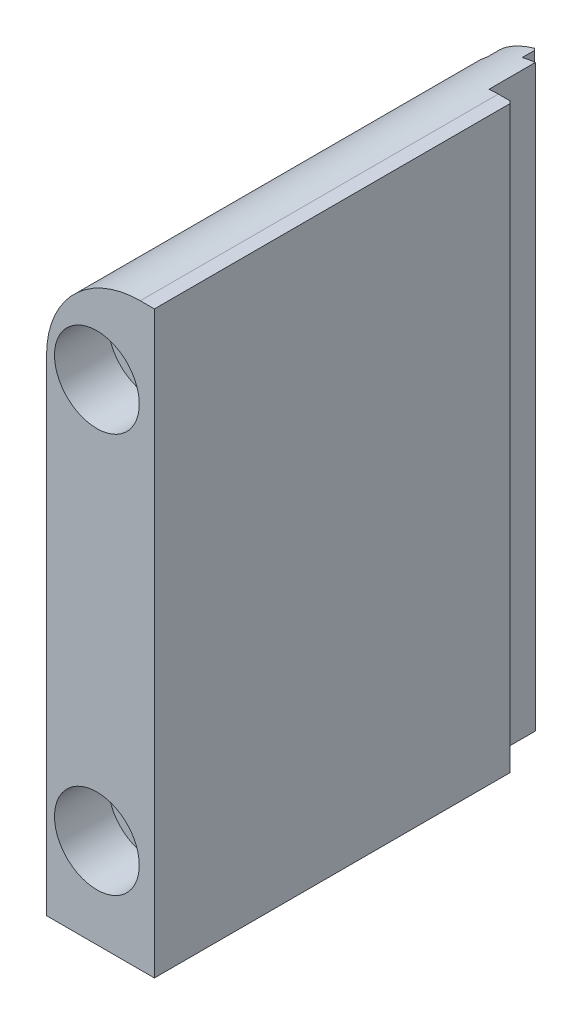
ISO-10303-21;
HEADER;
FILE_DESCRIPTION(('STEP AP214'),'2;1');
FILE_NAME('part.step','',(''),(''),'','','');
FILE_SCHEMA(('AUTOMOTIVE_DESIGN { 1 0 10303 214 1 1 1 1 }'));
ENDSEC;
DATA;
#1=APPLICATION_CONTEXT('core data for automotive mechanical design processes');
#2=APPLICATION_PROTOCOL_DEFINITION('international standard','automotive_design',2000,#1);
#3=PRODUCT_CONTEXT('',#1,'mechanical');
#4=PRODUCT('Part','Part','',(#3));
#5=PRODUCT_RELATED_PRODUCT_CATEGORY('part','',(#4));
#6=PRODUCT_DEFINITION_FORMATION('','',#4);
#7=PRODUCT_DEFINITION_CONTEXT('part definition',#1,'design');
#8=PRODUCT_DEFINITION('design','',#6,#7);
#9=PRODUCT_DEFINITION_SHAPE('','',#8);
#10=(LENGTH_UNIT() NAMED_UNIT(*) SI_UNIT(.MILLI.,.METRE.));
#11=(NAMED_UNIT(*) PLANE_ANGLE_UNIT() SI_UNIT($,.RADIAN.));
#12=(NAMED_UNIT(*) SI_UNIT($,.STERADIAN.) SOLID_ANGLE_UNIT());
#13=UNCERTAINTY_MEASURE_WITH_UNIT(LENGTH_MEASURE(1.E-05),#10,'distance_accuracy_value','');
#14=(GEOMETRIC_REPRESENTATION_CONTEXT(3) GLOBAL_UNCERTAINTY_ASSIGNED_CONTEXT((#13)) GLOBAL_UNIT_ASSIGNED_CONTEXT((#10,
#11,#12)) REPRESENTATION_CONTEXT('',''));
#15=CARTESIAN_POINT('',(0.,0.,0.));
#16=DIRECTION('',(0.,0.,1.));
#17=DIRECTION('',(1.,0.,0.));
#18=AXIS2_PLACEMENT_3D('',#15,#16,#17);
#19=CARTESIAN_POINT('',(-7.32028,29.845,-41.656));
#20=DIRECTION('',(0.,0.,-1.));
#21=DIRECTION('',(1.,0.,0.));
#22=AXIS2_PLACEMENT_3D('',#19,#20,#21);
#23=PLANE('',#22);
#24=CARTESIAN_POINT('',(-5.92328,-20.574,-41.656));
#25=DIRECTION('',(0.,0.,-1.));
#26=DIRECTION('',(-1.,0.,0.));
#27=AXIS2_PLACEMENT_3D('',#24,#25,#26);
#28=CIRCLE('',#27,2.7051);
#29=CARTESIAN_POINT('',(-8.62838,-20.574,-41.656));
#30=VERTEX_POINT('',#29);
#31=EDGE_CURVE('E408',#30,#30,#28,.T.);
#32=ORIENTED_EDGE('',*,*,#31,.F.);
#33=EDGE_LOOP('',(#32));
#34=FACE_BOUND('',#33,.T.);
#35=CARTESIAN_POINT('',(-5.92328,20.574,-41.656));
#36=DIRECTION('',(0.,0.,-1.));
#37=DIRECTION('',(-1.,0.,0.));
#38=AXIS2_PLACEMENT_3D('',#35,#36,#37);
#39=CIRCLE('',#38,2.7051);
#40=CARTESIAN_POINT('',(-8.62838,20.574,-41.656));
#41=VERTEX_POINT('',#40);
#42=EDGE_CURVE('E490',#41,#41,#39,.T.);
#43=ORIENTED_EDGE('',*,*,#42,.F.);
#44=EDGE_LOOP('',(#43));
#45=FACE_BOUND('',#44,.T.);
#46=DIRECTION('',(-0.999999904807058,0.000436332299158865,0.));
#47=VECTOR('',#46,1.);
#48=CARTESIAN_POINT('',(-7.32432497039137,20.5746113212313,-41.656));
#49=LINE('',#48,#47);
#50=CARTESIAN_POINT('',(-2.74802630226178,20.5726145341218,-41.656));
#51=VERTEX_POINT('',#50);
#52=CARTESIAN_POINT('',(-2.7482803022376,20.5726146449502,-41.656));
#53=VERTEX_POINT('',#52);
#54=EDGE_CURVE('E253',#51,#53,#49,.T.);
#55=ORIENTED_EDGE('',*,*,#54,.T.);
#56=CARTESIAN_POINT('',(-5.92328,20.574,-41.656));
#57=DIRECTION('',(0.,0.,1.));
#58=DIRECTION('',(1.,0.,0.));
#59=AXIS2_PLACEMENT_3D('',#56,#57,#58);
#60=CIRCLE('',#59,3.175);
#61=CARTESIAN_POINT('',(-2.74828,20.574,-41.656));
#62=VERTEX_POINT('',#61);
#63=EDGE_CURVE('E359',#62,#53,#60,.T.);
#64=ORIENTED_EDGE('',*,*,#63,.F.);
#65=DIRECTION('',(-1.,0.,0.));
#66=VECTOR('',#65,1.);
#67=CARTESIAN_POINT('',(-7.32028,20.574,-41.656));
#68=LINE('',#67,#66);
#69=CARTESIAN_POINT('',(-2.748026,20.574,-41.656));
#70=VERTEX_POINT('',#69);
#71=EDGE_CURVE('E446',#62,#70,#68,.F.);
#72=ORIENTED_EDGE('',*,*,#71,.T.);
#73=CARTESIAN_POINT('',(-5.92328,20.574,-41.656));
#74=DIRECTION('',(0.,0.,-1.));
#75=DIRECTION('',(-1.,0.,0.));
#76=AXIS2_PLACEMENT_3D('',#73,#74,#75);
#77=CIRCLE('',#76,3.175254);
#78=CARTESIAN_POINT('',(-3.76428,22.9022948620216,-41.656));
#79=VERTEX_POINT('',#78);
#80=EDGE_CURVE('E633',#79,#70,#77,.T.);
#81=ORIENTED_EDGE('',*,*,#80,.F.);
#82=DIRECTION('',(0.,-1.,0.));
#83=VECTOR('',#82,1.);
#84=CARTESIAN_POINT('',(-3.76428,29.845,-41.656));
#85=LINE('',#84,#83);
#86=CARTESIAN_POINT('',(-3.76428,29.5641543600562,-41.656));
#87=VERTEX_POINT('',#86);
#88=EDGE_CURVE('E262',#87,#79,#85,.T.);
#89=ORIENTED_EDGE('',*,*,#88,.F.);
#90=CARTESIAN_POINT('',(-1.45288000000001,20.193,-41.656));
#91=DIRECTION('',(0.,0.,1.));
#92=DIRECTION('',(1.,0.,0.));
#93=AXIS2_PLACEMENT_3D('',#90,#91,#92);
#94=CIRCLE('',#93,9.652);
#95=CARTESIAN_POINT('',(-2.413,29.797127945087,-41.656));
#96=VERTEX_POINT('',#95);
#97=EDGE_CURVE('E297',#96,#87,#94,.T.);
#98=ORIENTED_EDGE('',*,*,#97,.F.);
#99=DIRECTION('',(0.,-1.,0.));
#100=VECTOR('',#99,1.);
#101=CARTESIAN_POINT('',(-2.40538,29.845,-41.656));
#102=LINE('',#101,#100);
#103=CARTESIAN_POINT('',(-2.40538,-29.845,-41.656));
#104=VERTEX_POINT('',#103);
#105=EDGE_CURVE('E760',#96,#104,#102,.T.);
#106=ORIENTED_EDGE('',*,*,#105,.T.);
#107=DIRECTION('',(-1.,0.,0.));
#108=VECTOR('',#107,1.);
#109=CARTESIAN_POINT('',(-2.34188,-29.845,-41.656));
#110=LINE('',#109,#108);
#111=CARTESIAN_POINT('',(-3.76428,-29.845,-41.656));
#112=VERTEX_POINT('',#111);
#113=EDGE_CURVE('E496',#104,#112,#110,.T.);
#114=ORIENTED_EDGE('',*,*,#113,.T.);
#115=CARTESIAN_POINT('',(-3.76428,-22.9022948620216,-41.656));
#116=VERTEX_POINT('',#115);
#117=EDGE_CURVE('E263',#116,#112,#85,.T.);
#118=ORIENTED_EDGE('',*,*,#117,.F.);
#119=CARTESIAN_POINT('',(-5.92328,-20.574,-41.656));
#120=DIRECTION('',(0.,0.,-1.));
#121=DIRECTION('',(-1.,0.,0.));
#122=AXIS2_PLACEMENT_3D('',#119,#120,#121);
#123=CIRCLE('',#122,3.175254);
#124=CARTESIAN_POINT('',(-2.74802630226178,-20.5753854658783,-41.656));
#125=VERTEX_POINT('',#124);
#126=EDGE_CURVE('E461',#125,#116,#123,.T.);
#127=ORIENTED_EDGE('',*,*,#126,.F.);
#128=DIRECTION('',(-0.999999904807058,0.000436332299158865,0.));
#129=VECTOR('',#128,1.);
#130=CARTESIAN_POINT('',(-7.34227917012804,-20.5733808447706,-41.656));
#131=LINE('',#130,#129);
#132=CARTESIAN_POINT('',(-2.7482803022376,-20.5753853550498,-41.656));
#133=VERTEX_POINT('',#132);
#134=EDGE_CURVE('E445',#125,#133,#131,.T.);
#135=ORIENTED_EDGE('',*,*,#134,.T.);
#136=CARTESIAN_POINT('',(-5.92328,-20.574,-41.656));
#137=DIRECTION('',(0.,0.,1.));
#138=DIRECTION('',(1.,0.,0.));
#139=AXIS2_PLACEMENT_3D('',#136,#137,#138);
#140=CIRCLE('',#139,3.175);
#141=CARTESIAN_POINT('',(-2.74828,-20.574,-41.656));
#142=VERTEX_POINT('',#141);
#143=EDGE_CURVE('E378',#142,#133,#140,.T.);
#144=ORIENTED_EDGE('',*,*,#143,.F.);
#145=DIRECTION('',(-1.,0.,0.));
#146=VECTOR('',#145,1.);
#147=CARTESIAN_POINT('',(-7.32028,-20.574,-41.656));
#148=LINE('',#147,#146);
#149=CARTESIAN_POINT('',(-2.748026,-20.574,-41.656));
#150=VERTEX_POINT('',#149);
#151=EDGE_CURVE('E431',#142,#150,#148,.F.);
#152=ORIENTED_EDGE('',*,*,#151,.T.);
#153=CARTESIAN_POINT('',(-3.76428,-18.2457051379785,-41.656));
#154=VERTEX_POINT('',#153);
#155=EDGE_CURVE('E464',#154,#150,#123,.T.);
#156=ORIENTED_EDGE('',*,*,#155,.F.);
#157=CARTESIAN_POINT('',(-3.76428,18.2457051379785,-41.656));
#158=VERTEX_POINT('',#157);
#159=EDGE_CURVE('E260',#158,#154,#85,.T.);
#160=ORIENTED_EDGE('',*,*,#159,.F.);
#161=EDGE_CURVE('E641',#51,#158,#77,.T.);
#162=ORIENTED_EDGE('',*,*,#161,.F.);
#163=EDGE_LOOP('',(#55,#64,#72,#81,#89,#98,#106,#114,#118,#127,#135,#144,#152,#156,#160,#162));
#164=FACE_BOUND('',#163,.T.);
#165=ADVANCED_FACE('F16',(#34,#45,#164),#23,.T.);
#166=CARTESIAN_POINT('',(-5.92328,20.574,-31.2166));
#167=DIRECTION('',(0.,0.,1.));
#168=DIRECTION('',(1.,0.,0.));
#169=AXIS2_PLACEMENT_3D('',#166,#167,#168);
#170=CONICAL_SURFACE('',#169,3.3147,0.785398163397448);
#171=CARTESIAN_POINT('',(-5.92328,20.574,-31.8262));
#172=DIRECTION('',(0.,0.,1.));
#173=DIRECTION('',(1.,0.,0.));
#174=AXIS2_PLACEMENT_3D('',#171,#172,#173);
#175=CIRCLE('',#174,2.7051);
#176=CARTESIAN_POINT('',(-3.21818,20.574,-31.8262));
#177=VERTEX_POINT('',#176);
#178=EDGE_CURVE('E361',#177,#177,#175,.T.);
#179=ORIENTED_EDGE('',*,*,#178,.F.);
#180=EDGE_LOOP('',(#179));
#181=FACE_BOUND('',#180,.T.);
#182=CARTESIAN_POINT('',(-5.92328,20.574,-31.2166));
#183=DIRECTION('',(0.,0.,-1.));
#184=DIRECTION('',(-1.,0.,0.));
#185=AXIS2_PLACEMENT_3D('',#182,#183,#184);
#186=CIRCLE('',#185,3.3147);
#187=CARTESIAN_POINT('',(-9.23798,20.574,-31.2166));
#188=VERTEX_POINT('',#187);
#189=EDGE_CURVE('E405',#188,#188,#186,.T.);
#190=ORIENTED_EDGE('',*,*,#189,.F.);
#191=EDGE_LOOP('',(#190));
#192=FACE_BOUND('',#191,.T.);
#193=CARTESIAN_POINT('',(-5.92328,20.574,-31.3563));
#194=DIRECTION('',(0.,0.,1.));
#195=DIRECTION('',(1.,0.,0.));
#196=AXIS2_PLACEMENT_3D('',#193,#194,#195);
#197=CIRCLE('',#196,3.175);
#198=CARTESIAN_POINT('',(-2.7482803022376,20.5726146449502,-31.3563));
#199=VERTEX_POINT('',#198);
#200=CARTESIAN_POINT('',(-2.74828,20.574,-31.3563));
#201=VERTEX_POINT('',#200);
#202=EDGE_CURVE('E10',#199,#201,#197,.F.);
#203=ORIENTED_EDGE('',*,*,#202,.F.);
#204=DIRECTION('',(0.707106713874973,-0.000308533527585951,0.707106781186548));
#205=VECTOR('',#204,1.);
#206=CARTESIAN_POINT('',(-5.92328,20.574,-34.5313));
#207=LINE('',#206,#205);
#208=CARTESIAN_POINT('',(-2.74802630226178,20.5726145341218,-31.356046));
#209=VERTEX_POINT('',#208);
#210=EDGE_CURVE('E245',#209,#199,#207,.F.);
#211=ORIENTED_EDGE('',*,*,#210,.F.);
#212=CARTESIAN_POINT('',(-5.92328,20.574,-31.356046));
#213=DIRECTION('',(0.,0.,1.));
#214=DIRECTION('',(1.,0.,0.));
#215=AXIS2_PLACEMENT_3D('',#212,#213,#214);
#216=CIRCLE('',#215,3.175254);
#217=CARTESIAN_POINT('',(-2.748026,20.574,-31.356046));
#218=VERTEX_POINT('',#217);
#219=EDGE_CURVE('E237',#209,#218,#216,.F.);
#220=ORIENTED_EDGE('',*,*,#219,.T.);
#221=DIRECTION('',(0.707106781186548,0.,0.707106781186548));
#222=VECTOR('',#221,1.);
#223=CARTESIAN_POINT('',(-5.92328,20.574,-34.5313));
#224=LINE('',#223,#222);
#225=EDGE_CURVE('E26',#201,#218,#224,.T.);
#226=ORIENTED_EDGE('',*,*,#225,.F.);
#227=EDGE_LOOP('',(#203,#211,#220,#226));
#228=FACE_BOUND('',#227,.T.);
#229=ADVANCED_FACE('F256',(#181,#192,#228),#170,.F.);
#230=CARTESIAN_POINT('',(-7.32028,17.7225742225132,-41.656));
#231=VERTEX_POINT('',#230);
#232=CARTESIAN_POINT('',(-7.32028,23.4254257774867,-41.656));
#233=VERTEX_POINT('',#232);
#234=EDGE_CURVE('E611',#231,#233,#77,.T.);
#235=ORIENTED_EDGE('',*,*,#234,.F.);
#236=DIRECTION('',(0.,-1.,0.));
#237=VECTOR('',#236,1.);
#238=CARTESIAN_POINT('',(-7.32028,29.845,-41.656));
#239=LINE('',#238,#237);
#240=CARTESIAN_POINT('',(-7.32028,-17.7225742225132,-41.656));
#241=VERTEX_POINT('',#240);
#242=EDGE_CURVE('E20',#231,#241,#239,.T.);
#243=ORIENTED_EDGE('',*,*,#242,.T.);
#244=CARTESIAN_POINT('',(-7.32028,-23.4254257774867,-41.656));
#245=VERTEX_POINT('',#244);
#246=EDGE_CURVE('E465',#245,#241,#123,.T.);
#247=ORIENTED_EDGE('',*,*,#246,.F.);
#248=CARTESIAN_POINT('',(-7.32028,-29.845,-41.656));
#249=VERTEX_POINT('',#248);
#250=EDGE_CURVE('E279',#245,#249,#239,.T.);
#251=ORIENTED_EDGE('',*,*,#250,.T.);
#252=DIRECTION('',(-1.,0.,0.));
#253=VECTOR('',#252,1.);
#254=CARTESIAN_POINT('',(-7.32028,-29.845,-41.656));
#255=LINE('',#254,#253);
#256=CARTESIAN_POINT('',(-11.10488,-29.845,-41.656));
#257=VERTEX_POINT('',#256);
#258=EDGE_CURVE('E391',#249,#257,#255,.T.);
#259=ORIENTED_EDGE('',*,*,#258,.T.);
#260=DIRECTION('',(0.,-1.,0.));
#261=VECTOR('',#260,1.);
#262=CARTESIAN_POINT('',(-11.10488,29.845,-41.656));
#263=LINE('',#262,#261);
#264=CARTESIAN_POINT('',(-11.10488,20.193,-41.656));
#265=VERTEX_POINT('',#264);
#266=EDGE_CURVE('E280',#265,#257,#263,.T.);
#267=ORIENTED_EDGE('',*,*,#266,.F.);
#268=CARTESIAN_POINT('',(-1.45288000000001,20.193,-41.656));
#269=DIRECTION('',(0.,0.,1.));
#270=DIRECTION('',(1.,0.,0.));
#271=AXIS2_PLACEMENT_3D('',#268,#269,#270);
#272=CIRCLE('',#271,9.652);
#273=CARTESIAN_POINT('',(-7.32028,27.8568581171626,-41.656));
#274=VERTEX_POINT('',#273);
#275=EDGE_CURVE('E301',#274,#265,#272,.T.);
#276=ORIENTED_EDGE('',*,*,#275,.F.);
#277=EDGE_CURVE('E277',#274,#233,#239,.T.);
#278=ORIENTED_EDGE('',*,*,#277,.T.);
#279=EDGE_LOOP('',(#235,#243,#247,#251,#259,#267,#276,#278));
#280=FACE_BOUND('',#279,.T.);
#281=ADVANCED_FACE('F509',(#280),#23,.T.);
#282=CARTESIAN_POINT('',(-5.92328,-20.574,-31.2166));
#283=DIRECTION('',(0.,0.,1.));
#284=DIRECTION('',(1.,0.,0.));
#285=AXIS2_PLACEMENT_3D('',#282,#283,#284);
#286=CONICAL_SURFACE('',#285,3.3147,0.785398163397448);
#287=CARTESIAN_POINT('',(-5.92328,-20.574,-31.8262));
#288=DIRECTION('',(0.,0.,1.));
#289=DIRECTION('',(1.,0.,0.));
#290=AXIS2_PLACEMENT_3D('',#287,#288,#289);
#291=CIRCLE('',#290,2.7051);
#292=CARTESIAN_POINT('',(-3.21818,-20.574,-31.8262));
#293=VERTEX_POINT('',#292);
#294=EDGE_CURVE('E356',#293,#293,#291,.T.);
#295=ORIENTED_EDGE('',*,*,#294,.F.);
#296=EDGE_LOOP('',(#295));
#297=FACE_BOUND('',#296,.T.);
#298=CARTESIAN_POINT('',(-5.92328,-20.574,-31.2166));
#299=DIRECTION('',(0.,0.,-1.));
#300=DIRECTION('',(-1.,0.,0.));
#301=AXIS2_PLACEMENT_3D('',#298,#299,#300);
#302=CIRCLE('',#301,3.3147);
#303=CARTESIAN_POINT('',(-9.23798,-20.574,-31.2166));
#304=VERTEX_POINT('',#303);
#305=EDGE_CURVE('E364',#304,#304,#302,.T.);
#306=ORIENTED_EDGE('',*,*,#305,.F.);
#307=EDGE_LOOP('',(#306));
#308=FACE_BOUND('',#307,.T.);
#309=CARTESIAN_POINT('',(-5.92328,-20.574,-31.3563));
#310=DIRECTION('',(0.,0.,1.));
#311=DIRECTION('',(1.,0.,0.));
#312=AXIS2_PLACEMENT_3D('',#309,#310,#311);
#313=CIRCLE('',#312,3.175);
#314=CARTESIAN_POINT('',(-2.7482803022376,-20.5753853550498,-31.3563));
#315=VERTEX_POINT('',#314);
#316=CARTESIAN_POINT('',(-2.74828,-20.574,-31.3563));
#317=VERTEX_POINT('',#316);
#318=EDGE_CURVE('E246',#315,#317,#313,.F.);
#319=ORIENTED_EDGE('',*,*,#318,.F.);
#320=DIRECTION('',(0.707106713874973,-0.000308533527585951,0.707106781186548));
#321=VECTOR('',#320,1.);
#322=CARTESIAN_POINT('',(-5.92328,-20.574,-34.5313));
#323=LINE('',#322,#321);
#324=CARTESIAN_POINT('',(-2.74802630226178,-20.5753854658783,-31.356046));
#325=VERTEX_POINT('',#324);
#326=EDGE_CURVE('E411',#325,#315,#323,.F.);
#327=ORIENTED_EDGE('',*,*,#326,.F.);
#328=CARTESIAN_POINT('',(-5.92328,-20.574,-31.356046));
#329=DIRECTION('',(0.,0.,1.));
#330=DIRECTION('',(1.,0.,0.));
#331=AXIS2_PLACEMENT_3D('',#328,#329,#330);
#332=CIRCLE('',#331,3.175254);
#333=CARTESIAN_POINT('',(-2.748026,-20.574,-31.356046));
#334=VERTEX_POINT('',#333);
#335=EDGE_CURVE('E355',#325,#334,#332,.F.);
#336=ORIENTED_EDGE('',*,*,#335,.T.);
#337=DIRECTION('',(0.707106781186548,0.,0.707106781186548));
#338=VECTOR('',#337,1.);
#339=CARTESIAN_POINT('',(-5.92328,-20.574,-34.5313));
#340=LINE('',#339,#338);
#341=EDGE_CURVE('E412',#317,#334,#340,.T.);
#342=ORIENTED_EDGE('',*,*,#341,.F.);
#343=EDGE_LOOP('',(#319,#327,#336,#342));
#344=FACE_BOUND('',#343,.T.);
#345=ADVANCED_FACE('F434',(#297,#308,#344),#286,.F.);
#346=CARTESIAN_POINT('',(-3.76428,29.845,-41.656));
#347=DIRECTION('',(1.,0.,0.));
#348=DIRECTION('',(0.,0.,1.));
#349=AXIS2_PLACEMENT_3D('',#346,#347,#348);
#350=PLANE('',#349);
#351=DIRECTION('',(0.,0.,1.));
#352=VECTOR('',#351,1.);
#353=CARTESIAN_POINT('',(-3.76428,-22.9022948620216,-31.2166));
#354=LINE('',#353,#352);
#355=CARTESIAN_POINT('',(-3.76428,-22.9022948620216,-42.926));
#356=VERTEX_POINT('',#355);
#357=EDGE_CURVE('E459',#116,#356,#354,.F.);
#358=ORIENTED_EDGE('',*,*,#357,.F.);
#359=ORIENTED_EDGE('',*,*,#117,.T.);
#360=DIRECTION('',(0.,0.,-1.));
#361=VECTOR('',#360,1.);
#362=CARTESIAN_POINT('',(-3.76428,-29.845,-41.656));
#363=LINE('',#362,#361);
#364=CARTESIAN_POINT('',(-3.76428,-29.845,-42.926));
#365=VERTEX_POINT('',#364);
#366=EDGE_CURVE('E499',#112,#365,#363,.T.);
#367=ORIENTED_EDGE('',*,*,#366,.T.);
#368=DIRECTION('',(0.,1.,0.));
#369=VECTOR('',#368,1.);
#370=CARTESIAN_POINT('',(-3.76428,29.845,-42.926));
#371=LINE('',#370,#369);
#372=EDGE_CURVE('E344',#365,#356,#371,.T.);
#373=ORIENTED_EDGE('',*,*,#372,.T.);
#374=EDGE_LOOP('',(#358,#359,#367,#373));
#375=FACE_BOUND('',#374,.T.);
#376=ADVANCED_FACE('F552',(#375),#350,.T.);
#377=CARTESIAN_POINT('',(-7.32028,29.845,-42.926));
#378=DIRECTION('',(0.707106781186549,0.,0.707106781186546));
#379=DIRECTION('',(0.707106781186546,0.,-0.707106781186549));
#380=AXIS2_PLACEMENT_3D('',#377,#378,#379);
#381=PLANE('',#380);
#382=CARTESIAN_POINT('',(-5.92328,-20.574,-44.323));
#383=DIRECTION('',(0.707106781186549,0.,0.707106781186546));
#384=DIRECTION('',(-0.707106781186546,0.,0.707106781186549));
#385=AXIS2_PLACEMENT_3D('',#382,#383,#384);
#386=ELLIPSE('',#385,4.49048727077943,3.175254);
#387=CARTESIAN_POINT('',(-7.06628,-23.5363958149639,-43.18));
#388=VERTEX_POINT('',#387);
#389=CARTESIAN_POINT('',(-7.32028,-23.4254257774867,-42.926));
#390=VERTEX_POINT('',#389);
#391=EDGE_CURVE('E457',#388,#390,#386,.F.);
#392=ORIENTED_EDGE('',*,*,#391,.F.);
#393=DIRECTION('',(0.,1.,0.));
#394=VECTOR('',#393,1.);
#395=CARTESIAN_POINT('',(-7.06628,29.845,-43.18));
#396=LINE('',#395,#394);
#397=CARTESIAN_POINT('',(-7.06628,-29.845,-43.18));
#398=VERTEX_POINT('',#397);
#399=EDGE_CURVE('E335',#398,#388,#396,.T.);
#400=ORIENTED_EDGE('',*,*,#399,.F.);
#401=DIRECTION('',(-0.707106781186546,0.,0.707106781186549));
#402=VECTOR('',#401,1.);
#403=CARTESIAN_POINT('',(-7.32028,-29.845,-42.926));
#404=LINE('',#403,#402);
#405=CARTESIAN_POINT('',(-7.32028,-29.845,-42.926));
#406=VERTEX_POINT('',#405);
#407=EDGE_CURVE('E325',#406,#398,#404,.F.);
#408=ORIENTED_EDGE('',*,*,#407,.F.);
#409=DIRECTION('',(0.,-1.,0.));
#410=VECTOR('',#409,1.);
#411=CARTESIAN_POINT('',(-7.32028,29.845,-42.926));
#412=LINE('',#411,#410);
#413=EDGE_CURVE('E303',#390,#406,#412,.T.);
#414=ORIENTED_EDGE('',*,*,#413,.F.);
#415=EDGE_LOOP('',(#392,#400,#408,#414));
#416=FACE_BOUND('',#415,.T.);
#417=ADVANCED_FACE('F532',(#416),#381,.F.);
#418=CARTESIAN_POINT('',(-3.76428,29.845,-43.18));
#419=DIRECTION('',(0.,0.,-1.));
#420=DIRECTION('',(1.,0.,0.));
#421=AXIS2_PLACEMENT_3D('',#418,#419,#420);
#422=PLANE('',#421);
#423=CARTESIAN_POINT('',(-5.92328,20.574,-43.18));
#424=DIRECTION('',(0.,0.,-1.));
#425=DIRECTION('',(-1.,0.,0.));
#426=AXIS2_PLACEMENT_3D('',#423,#424,#425);
#427=CIRCLE('',#426,3.175254);
#428=CARTESIAN_POINT('',(-4.01828,18.0336825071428,-43.18));
#429=VERTEX_POINT('',#428);
#430=CARTESIAN_POINT('',(-7.06628,17.6116041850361,-43.18));
#431=VERTEX_POINT('',#430);
#432=EDGE_CURVE('E624',#429,#431,#427,.T.);
#433=ORIENTED_EDGE('',*,*,#432,.F.);
#434=DIRECTION('',(0.,-1.,0.));
#435=VECTOR('',#434,1.);
#436=CARTESIAN_POINT('',(-4.01828,29.845,-43.18));
#437=LINE('',#436,#435);
#438=CARTESIAN_POINT('',(-4.01828,-18.0336825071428,-43.18));
#439=VERTEX_POINT('',#438);
#440=EDGE_CURVE('E334',#429,#439,#437,.T.);
#441=ORIENTED_EDGE('',*,*,#440,.T.);
#442=CARTESIAN_POINT('',(-5.92328,-20.574,-43.18));
#443=DIRECTION('',(0.,0.,-1.));
#444=DIRECTION('',(-1.,0.,0.));
#445=AXIS2_PLACEMENT_3D('',#442,#443,#444);
#446=CIRCLE('',#445,3.175254);
#447=CARTESIAN_POINT('',(-7.06628,-17.6116041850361,-43.18));
#448=VERTEX_POINT('',#447);
#449=EDGE_CURVE('E472',#448,#439,#446,.T.);
#450=ORIENTED_EDGE('',*,*,#449,.F.);
#451=EDGE_CURVE('E339',#448,#431,#396,.T.);
#452=ORIENTED_EDGE('',*,*,#451,.T.);
#453=EDGE_LOOP('',(#433,#441,#450,#452));
#454=FACE_BOUND('',#453,.T.);
#455=ADVANCED_FACE('F623',(#454),#422,.T.);
#456=CARTESIAN_POINT('',(-7.32028,29.845,-43.18));
#457=DIRECTION('',(-1.,0.,0.));
#458=DIRECTION('',(0.,0.,-1.));
#459=AXIS2_PLACEMENT_3D('',#456,#457,#458);
#460=PLANE('',#459);
#461=DIRECTION('',(0.,0.,1.));
#462=VECTOR('',#461,1.);
#463=CARTESIAN_POINT('',(-7.32028,17.7225742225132,-31.2166));
#464=LINE('',#463,#462);
#465=CARTESIAN_POINT('',(-7.32028,17.7225742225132,-42.926));
#466=VERTEX_POINT('',#465);
#467=EDGE_CURVE('E610',#466,#231,#464,.T.);
#468=ORIENTED_EDGE('',*,*,#467,.F.);
#469=CARTESIAN_POINT('',(-7.32028,-17.7225742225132,-42.926));
#470=VERTEX_POINT('',#469);
#471=EDGE_CURVE('E307',#466,#470,#412,.T.);
#472=ORIENTED_EDGE('',*,*,#471,.T.);
#473=DIRECTION('',(0.,0.,1.));
#474=VECTOR('',#473,1.);
#475=CARTESIAN_POINT('',(-7.32028,-17.7225742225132,-31.2166));
#476=LINE('',#475,#474);
#477=EDGE_CURVE('E467',#241,#470,#476,.F.);
#478=ORIENTED_EDGE('',*,*,#477,.F.);
#479=ORIENTED_EDGE('',*,*,#242,.F.);
#480=EDGE_LOOP('',(#468,#472,#478,#479));
#481=FACE_BOUND('',#480,.T.);
#482=ADVANCED_FACE('F593',(#481),#460,.T.);
#483=CARTESIAN_POINT('',(-4.01828,29.845,-43.18));
#484=DIRECTION('',(-0.707106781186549,0.,0.707106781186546));
#485=DIRECTION('',(0.707106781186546,0.,0.707106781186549));
#486=AXIS2_PLACEMENT_3D('',#483,#484,#485);
#487=PLANE('',#486);
#488=CARTESIAN_POINT('',(-5.92328,20.574,-45.085));
#489=DIRECTION('',(-0.707106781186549,0.,0.707106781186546));
#490=DIRECTION('',(0.707106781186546,0.,0.707106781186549));
#491=AXIS2_PLACEMENT_3D('',#488,#489,#490);
#492=ELLIPSE('',#491,4.49048727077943,3.175254);
#493=CARTESIAN_POINT('',(-3.76428,18.2457051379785,-42.926));
#494=VERTEX_POINT('',#493);
#495=EDGE_CURVE('E638',#494,#429,#492,.F.);
#496=ORIENTED_EDGE('',*,*,#495,.F.);
#497=CARTESIAN_POINT('',(-3.76428,-18.2457051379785,-42.926));
#498=VERTEX_POINT('',#497);
#499=EDGE_CURVE('E348',#498,#494,#371,.T.);
#500=ORIENTED_EDGE('',*,*,#499,.F.);
#501=CARTESIAN_POINT('',(-5.92328,-20.574,-45.085));
#502=DIRECTION('',(-0.707106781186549,0.,0.707106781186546));
#503=DIRECTION('',(0.707106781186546,0.,0.707106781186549));
#504=AXIS2_PLACEMENT_3D('',#501,#502,#503);
#505=ELLIPSE('',#504,4.49048727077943,3.175254);
#506=EDGE_CURVE('E475',#439,#498,#505,.F.);
#507=ORIENTED_EDGE('',*,*,#506,.F.);
#508=ORIENTED_EDGE('',*,*,#440,.F.);
#509=EDGE_LOOP('',(#496,#500,#507,#508));
#510=FACE_BOUND('',#509,.T.);
#511=ADVANCED_FACE('F587',(#510),#487,.F.);
#512=DIRECTION('',(0.,0.,1.));
#513=VECTOR('',#512,1.);
#514=CARTESIAN_POINT('',(-3.76428,18.2457051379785,-31.2166));
#515=LINE('',#514,#513);
#516=EDGE_CURVE('E640',#158,#494,#515,.F.);
#517=ORIENTED_EDGE('',*,*,#516,.F.);
#518=ORIENTED_EDGE('',*,*,#159,.T.);
#519=DIRECTION('',(0.,0.,1.));
#520=VECTOR('',#519,1.);
#521=CARTESIAN_POINT('',(-3.76428,-18.2457051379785,-31.2166));
#522=LINE('',#521,#520);
#523=EDGE_CURVE('E477',#498,#154,#522,.T.);
#524=ORIENTED_EDGE('',*,*,#523,.F.);
#525=ORIENTED_EDGE('',*,*,#499,.T.);
#526=EDGE_LOOP('',(#517,#518,#524,#525));
#527=FACE_BOUND('',#526,.T.);
#528=ADVANCED_FACE('F560',(#527),#350,.T.);
#529=CARTESIAN_POINT('',(-5.92328,20.574,-43.18));
#530=DIRECTION('',(0.,0.,-1.));
#531=DIRECTION('',(-1.,0.,0.));
#532=AXIS2_PLACEMENT_3D('',#529,#530,#531);
#533=CIRCLE('',#532,3.175254);
#534=CARTESIAN_POINT('',(-7.06628,23.5363958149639,-43.18));
#535=VERTEX_POINT('',#534);
#536=CARTESIAN_POINT('',(-4.01828,23.1143174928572,-43.18));
#537=VERTEX_POINT('',#536);
#538=EDGE_CURVE('E616',#535,#537,#533,.T.);
#539=ORIENTED_EDGE('',*,*,#538,.F.);
#540=CARTESIAN_POINT('',(-7.06628,28.0448051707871,-43.18));
#541=VERTEX_POINT('',#540);
#542=EDGE_CURVE('E333',#535,#541,#396,.T.);
#543=ORIENTED_EDGE('',*,*,#542,.T.);
#544=CARTESIAN_POINT('',(-1.45288000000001,20.193,-43.18));
#545=DIRECTION('',(0.,0.,1.));
#546=DIRECTION('',(1.,0.,0.));
#547=AXIS2_PLACEMENT_3D('',#544,#545,#546);
#548=CIRCLE('',#547,9.652);
#549=CARTESIAN_POINT('',(-4.01828,29.4978281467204,-43.18));
#550=VERTEX_POINT('',#549);
#551=EDGE_CURVE('E296',#550,#541,#548,.T.);
#552=ORIENTED_EDGE('',*,*,#551,.F.);
#553=EDGE_CURVE('E330',#550,#537,#437,.T.);
#554=ORIENTED_EDGE('',*,*,#553,.T.);
#555=EDGE_LOOP('',(#539,#543,#552,#554));
#556=FACE_BOUND('',#555,.T.);
#557=ADVANCED_FACE('F615',(#556),#422,.T.);
#558=DIRECTION('',(0.,0.,1.));
#559=VECTOR('',#558,1.);
#560=CARTESIAN_POINT('',(-7.32028,23.4254257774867,-31.2166));
#561=LINE('',#560,#559);
#562=CARTESIAN_POINT('',(-7.32028,23.4254257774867,-42.926));
#563=VERTEX_POINT('',#562);
#564=EDGE_CURVE('E34',#233,#563,#561,.F.);
#565=ORIENTED_EDGE('',*,*,#564,.F.);
#566=ORIENTED_EDGE('',*,*,#277,.F.);
#567=DIRECTION('',(0.,0.,1.));
#568=VECTOR('',#567,1.);
#569=CARTESIAN_POINT('',(-7.32028,27.8568581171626,-43.18));
#570=LINE('',#569,#568);
#571=CARTESIAN_POINT('',(-7.32028,27.8568581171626,-42.926));
#572=VERTEX_POINT('',#571);
#573=EDGE_CURVE('E300',#572,#274,#570,.T.);
#574=ORIENTED_EDGE('',*,*,#573,.F.);
#575=EDGE_CURVE('E309',#572,#563,#412,.T.);
#576=ORIENTED_EDGE('',*,*,#575,.T.);
#577=EDGE_LOOP('',(#565,#566,#574,#576));
#578=FACE_BOUND('',#577,.T.);
#579=ADVANCED_FACE('F602',(#578),#460,.T.);
#580=CARTESIAN_POINT('',(-5.92328,20.574,-44.323));
#581=DIRECTION('',(0.707106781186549,0.,0.707106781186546));
#582=DIRECTION('',(-0.707106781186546,0.,0.707106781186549));
#583=AXIS2_PLACEMENT_3D('',#580,#581,#582);
#584=ELLIPSE('',#583,4.49048727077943,3.175254);
#585=EDGE_CURVE('E629',#431,#466,#584,.F.);
#586=ORIENTED_EDGE('',*,*,#585,.F.);
#587=ORIENTED_EDGE('',*,*,#451,.F.);
#588=CARTESIAN_POINT('',(-5.92328,-20.574,-44.323));
#589=DIRECTION('',(0.707106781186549,0.,0.707106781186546));
#590=DIRECTION('',(-0.707106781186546,0.,0.707106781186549));
#591=AXIS2_PLACEMENT_3D('',#588,#589,#590);
#592=ELLIPSE('',#591,4.49048727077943,3.175254);
#593=EDGE_CURVE('E470',#470,#448,#592,.F.);
#594=ORIENTED_EDGE('',*,*,#593,.F.);
#595=ORIENTED_EDGE('',*,*,#471,.F.);
#596=EDGE_LOOP('',(#586,#587,#594,#595));
#597=FACE_BOUND('',#596,.T.);
#598=ADVANCED_FACE('F533',(#597),#381,.F.);
#599=CARTESIAN_POINT('',(-5.92328,20.574,-45.085));
#600=DIRECTION('',(-0.707106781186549,0.,0.707106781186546));
#601=DIRECTION('',(0.707106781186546,0.,0.707106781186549));
#602=AXIS2_PLACEMENT_3D('',#599,#600,#601);
#603=ELLIPSE('',#602,4.49048727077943,3.175254);
#604=CARTESIAN_POINT('',(-3.76428,22.9022948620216,-42.926));
#605=VERTEX_POINT('',#604);
#606=EDGE_CURVE('E607',#537,#605,#603,.F.);
#607=ORIENTED_EDGE('',*,*,#606,.F.);
#608=ORIENTED_EDGE('',*,*,#553,.F.);
#609=CARTESIAN_POINT('',(-1.45288000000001,20.193,-40.6146));
#610=DIRECTION('',(-0.707106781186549,0.,0.707106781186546));
#611=DIRECTION('',(0.707106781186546,0.,0.707106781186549));
#612=AXIS2_PLACEMENT_3D('',#609,#610,#611);
#613=ELLIPSE('',#612,13.6499893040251,9.652);
#614=CARTESIAN_POINT('',(-3.76428,29.5641543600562,-42.926));
#615=VERTEX_POINT('',#614);
#616=EDGE_CURVE('E338',#615,#550,#613,.T.);
#617=ORIENTED_EDGE('',*,*,#616,.F.);
#618=EDGE_CURVE('E343',#605,#615,#371,.T.);
#619=ORIENTED_EDGE('',*,*,#618,.F.);
#620=EDGE_LOOP('',(#607,#608,#617,#619));
#621=FACE_BOUND('',#620,.T.);
#622=ADVANCED_FACE('F588',(#621),#487,.F.);
#623=CARTESIAN_POINT('',(-11.10488,29.845,-41.656));
#624=DIRECTION('',(-1.,0.,0.));
#625=DIRECTION('',(0.,0.,-1.));
#626=AXIS2_PLACEMENT_3D('',#623,#624,#625);
#627=PLANE('',#626);
#628=ORIENTED_EDGE('',*,*,#266,.T.);
#629=DIRECTION('',(0.,0.,1.));
#630=VECTOR('',#629,1.);
#631=CARTESIAN_POINT('',(-11.10488,-29.845,-41.656));
#632=LINE('',#631,#630);
#633=CARTESIAN_POINT('',(-11.10488,-29.845,0.));
#634=VERTEX_POINT('',#633);
#635=EDGE_CURVE('E268',#257,#634,#632,.T.);
#636=ORIENTED_EDGE('',*,*,#635,.T.);
#637=DIRECTION('',(0.,-1.,0.));
#638=VECTOR('',#637,1.);
#639=CARTESIAN_POINT('',(-11.10488,29.845,0.));
#640=LINE('',#639,#638);
#641=CARTESIAN_POINT('',(-11.10488,20.193,0.));
#642=VERTEX_POINT('',#641);
#643=EDGE_CURVE('E369',#642,#634,#640,.T.);
#644=ORIENTED_EDGE('',*,*,#643,.F.);
#645=DIRECTION('',(0.,0.,1.));
#646=VECTOR('',#645,1.);
#647=CARTESIAN_POINT('',(-11.10488,20.193,-41.656));
#648=LINE('',#647,#646);
#649=EDGE_CURVE('E366',#265,#642,#648,.T.);
#650=ORIENTED_EDGE('',*,*,#649,.F.);
#651=EDGE_LOOP('',(#628,#636,#644,#650));
#652=FACE_BOUND('',#651,.T.);
#653=ADVANCED_FACE('F513',(#652),#627,.T.);
#654=CARTESIAN_POINT('',(-11.07948,29.845,0.));
#655=DIRECTION('',(0.,0.,1.));
#656=DIRECTION('',(-1.,0.,0.));
#657=AXIS2_PLACEMENT_3D('',#654,#655,#656);
#658=PLANE('',#657);
#659=CARTESIAN_POINT('',(-5.92328,-20.574,0.));
#660=DIRECTION('',(0.,0.,1.));
#661=DIRECTION('',(1.,0.,0.));
#662=AXIS2_PLACEMENT_3D('',#659,#660,#661);
#663=CIRCLE('',#662,4.365625);
#664=CARTESIAN_POINT('',(-1.557655,-20.574,0.));
#665=VERTEX_POINT('',#664);
#666=EDGE_CURVE('E374',#665,#665,#663,.F.);
#667=ORIENTED_EDGE('',*,*,#666,.T.);
#668=EDGE_LOOP('',(#667));
#669=FACE_BOUND('',#668,.T.);
#670=CARTESIAN_POINT('',(-5.92328,20.574,0.));
#671=DIRECTION('',(0.,0.,1.));
#672=DIRECTION('',(1.,0.,0.));
#673=AXIS2_PLACEMENT_3D('',#670,#671,#672);
#674=CIRCLE('',#673,4.365625);
#675=CARTESIAN_POINT('',(-1.557655,20.574,0.));
#676=VERTEX_POINT('',#675);
#677=EDGE_CURVE('E379',#676,#676,#674,.F.);
#678=ORIENTED_EDGE('',*,*,#677,.T.);
#679=EDGE_LOOP('',(#678));
#680=FACE_BOUND('',#679,.T.);
#681=ORIENTED_EDGE('',*,*,#643,.T.);
#682=DIRECTION('',(1.,0.,0.));
#683=VECTOR('',#682,1.);
#684=CARTESIAN_POINT('',(-11.07948,-29.845,0.));
#685=LINE('',#684,#683);
#686=CARTESIAN_POINT('',(0.,-29.845,0.));
#687=VERTEX_POINT('',#686);
#688=EDGE_CURVE('E395',#634,#687,#685,.T.);
#689=ORIENTED_EDGE('',*,*,#688,.T.);
#690=DIRECTION('',(0.,-1.,0.));
#691=VECTOR('',#690,1.);
#692=CARTESIAN_POINT('',(0.,29.845,0.));
#693=LINE('',#692,#691);
#694=CARTESIAN_POINT('',(0.,29.845,0.));
#695=VERTEX_POINT('',#694);
#696=EDGE_CURVE('E385',#695,#687,#693,.T.);
#697=ORIENTED_EDGE('',*,*,#696,.F.);
#698=DIRECTION('',(1.,0.,0.));
#699=VECTOR('',#698,1.);
#700=CARTESIAN_POINT('',(-11.07948,29.845,0.));
#701=LINE('',#700,#699);
#702=CARTESIAN_POINT('',(-1.45288000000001,29.845,0.));
#703=VERTEX_POINT('',#702);
#704=EDGE_CURVE('E388',#703,#695,#701,.T.);
#705=ORIENTED_EDGE('',*,*,#704,.F.);
#706=CARTESIAN_POINT('',(-1.45288000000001,20.193,0.));
#707=DIRECTION('',(0.,0.,1.));
#708=DIRECTION('',(1.,0.,0.));
#709=AXIS2_PLACEMENT_3D('',#706,#707,#708);
#710=CIRCLE('',#709,9.652);
#711=EDGE_CURVE('E368',#642,#703,#710,.F.);
#712=ORIENTED_EDGE('',*,*,#711,.F.);
#713=EDGE_LOOP('',(#681,#689,#697,#705,#712));
#714=FACE_BOUND('',#713,.T.);
#715=ADVANCED_FACE('F515',(#669,#680,#714),#658,.T.);
#716=CARTESIAN_POINT('',(0.,29.845,-25.4));
#717=DIRECTION('',(1.,0.,0.));
#718=DIRECTION('',(0.,0.,1.));
#719=AXIS2_PLACEMENT_3D('',#716,#717,#718);
#720=PLANE('',#719);
#721=DIRECTION('',(0.,0.,-1.));
#722=VECTOR('',#721,1.);
#723=CARTESIAN_POINT('',(0.,-29.845,-36.8808));
#724=LINE('',#723,#722);
#725=CARTESIAN_POINT('',(0.,-29.845,-36.6268));
#726=VERTEX_POINT('',#725);
#727=EDGE_CURVE('E398',#687,#726,#724,.T.);
#728=ORIENTED_EDGE('',*,*,#727,.T.);
#729=DIRECTION('',(0.,1.,0.));
#730=VECTOR('',#729,1.);
#731=CARTESIAN_POINT('',(0.,29.845,-36.6268));
#732=LINE('',#731,#730);
#733=CARTESIAN_POINT('',(0.,29.845,-36.6268));
#734=VERTEX_POINT('',#733);
#735=EDGE_CURVE('E351',#726,#734,#732,.T.);
#736=ORIENTED_EDGE('',*,*,#735,.T.);
#737=DIRECTION('',(0.,0.,-1.));
#738=VECTOR('',#737,1.);
#739=CARTESIAN_POINT('',(0.,29.845,-36.8808));
#740=LINE('',#739,#738);
#741=EDGE_CURVE('E291',#695,#734,#740,.T.);
#742=ORIENTED_EDGE('',*,*,#741,.F.);
#743=ORIENTED_EDGE('',*,*,#696,.T.);
#744=EDGE_LOOP('',(#728,#736,#742,#743));
#745=FACE_BOUND('',#744,.T.);
#746=ADVANCED_FACE('F703',(#745),#720,.T.);
#747=CARTESIAN_POINT('',(0.00380999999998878,29.845,-36.8808));
#748=DIRECTION('',(0.,0.,-1.));
#749=DIRECTION('',(1.,0.,0.));
#750=AXIS2_PLACEMENT_3D('',#747,#748,#749);
#751=PLANE('',#750);
#752=DIRECTION('',(-1.,0.,0.));
#753=VECTOR('',#752,1.);
#754=CARTESIAN_POINT('',(0.00380999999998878,29.845,-36.8808));
#755=LINE('',#754,#753);
#756=CARTESIAN_POINT('',(-0.254000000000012,29.845,-36.8808));
#757=VERTEX_POINT('',#756);
#758=CARTESIAN_POINT('',(-1.45288000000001,29.845,-36.8808));
#759=VERTEX_POINT('',#758);
#760=EDGE_CURVE('E286',#757,#759,#755,.T.);
#761=ORIENTED_EDGE('',*,*,#760,.F.);
#762=DIRECTION('',(0.,-1.,0.));
#763=VECTOR('',#762,1.);
#764=CARTESIAN_POINT('',(-0.254000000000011,29.845,-36.8808));
#765=LINE('',#764,#763);
#766=CARTESIAN_POINT('',(-0.254000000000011,-29.845,-36.8808));
#767=VERTEX_POINT('',#766);
#768=EDGE_CURVE('E347',#757,#767,#765,.T.);
#769=ORIENTED_EDGE('',*,*,#768,.T.);
#770=DIRECTION('',(-1.,0.,0.));
#771=VECTOR('',#770,1.);
#772=CARTESIAN_POINT('',(0.00380999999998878,-29.845,-36.8808));
#773=LINE('',#772,#771);
#774=CARTESIAN_POINT('',(-2.40538,-29.845,-36.8808));
#775=VERTEX_POINT('',#774);
#776=EDGE_CURVE('E493',#767,#775,#773,.T.);
#777=ORIENTED_EDGE('',*,*,#776,.T.);
#778=DIRECTION('',(0.,-1.,0.));
#779=VECTOR('',#778,1.);
#780=CARTESIAN_POINT('',(-2.40538,29.845,-36.8808));
#781=LINE('',#780,#779);
#782=CARTESIAN_POINT('',(-2.40538,29.797127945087,-36.8808));
#783=VERTEX_POINT('',#782);
#784=EDGE_CURVE('E394',#783,#775,#781,.T.);
#785=ORIENTED_EDGE('',*,*,#784,.F.);
#786=CARTESIAN_POINT('',(-1.45288000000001,20.193,-36.8808));
#787=DIRECTION('',(0.,0.,1.));
#788=DIRECTION('',(1.,0.,0.));
#789=AXIS2_PLACEMENT_3D('',#786,#787,#788);
#790=CIRCLE('',#789,9.652);
#791=EDGE_CURVE('E373',#759,#783,#790,.T.);
#792=ORIENTED_EDGE('',*,*,#791,.F.);
#793=EDGE_LOOP('',(#761,#769,#777,#785,#792));
#794=FACE_BOUND('',#793,.T.);
#795=ADVANCED_FACE('F709',(#794),#751,.T.);
#796=CARTESIAN_POINT('',(-2.40538,29.845,-36.8808));
#797=DIRECTION('',(1.,0.,0.));
#798=DIRECTION('',(0.,0.,1.));
#799=AXIS2_PLACEMENT_3D('',#796,#797,#798);
#800=PLANE('',#799);
#801=DIRECTION('',(0.,0.,-1.));
#802=VECTOR('',#801,1.);
#803=CARTESIAN_POINT('',(-2.40538,-29.845,-36.8808));
#804=LINE('',#803,#802);
#805=EDGE_CURVE('E495',#775,#104,#804,.T.);
#806=ORIENTED_EDGE('',*,*,#805,.T.);
#807=ORIENTED_EDGE('',*,*,#105,.F.);
#808=DIRECTION('',(0.,0.,1.));
#809=VECTOR('',#808,1.);
#810=CARTESIAN_POINT('',(-2.40538,29.7978866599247,-36.8808));
#811=LINE('',#810,#809);
#812=EDGE_CURVE('E749',#783,#96,#811,.F.);
#813=ORIENTED_EDGE('',*,*,#812,.F.);
#814=ORIENTED_EDGE('',*,*,#784,.T.);
#815=EDGE_LOOP('',(#806,#807,#813,#814));
#816=FACE_BOUND('',#815,.T.);
#817=ADVANCED_FACE('F716',(#816),#800,.T.);
#818=DIRECTION('',(0.,0.,1.));
#819=VECTOR('',#818,1.);
#820=CARTESIAN_POINT('',(-3.76428,22.9022948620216,-31.2166));
#821=LINE('',#820,#819);
#822=EDGE_CURVE('E631',#605,#79,#821,.T.);
#823=ORIENTED_EDGE('',*,*,#822,.F.);
#824=ORIENTED_EDGE('',*,*,#618,.T.);
#825=DIRECTION('',(0.,0.,1.));
#826=VECTOR('',#825,1.);
#827=CARTESIAN_POINT('',(-3.76428,29.5641543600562,-41.656));
#828=LINE('',#827,#826);
#829=EDGE_CURVE('E293',#87,#615,#828,.F.);
#830=ORIENTED_EDGE('',*,*,#829,.F.);
#831=ORIENTED_EDGE('',*,*,#88,.T.);
#832=EDGE_LOOP('',(#823,#824,#830,#831));
#833=FACE_BOUND('',#832,.T.);
#834=ADVANCED_FACE('F561',(#833),#350,.T.);
#835=CARTESIAN_POINT('',(-5.92328,-20.574,-43.18));
#836=DIRECTION('',(0.,0.,-1.));
#837=DIRECTION('',(-1.,0.,0.));
#838=AXIS2_PLACEMENT_3D('',#835,#836,#837);
#839=CIRCLE('',#838,3.175254);
#840=CARTESIAN_POINT('',(-4.01828,-23.1143174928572,-43.18));
#841=VERTEX_POINT('',#840);
#842=EDGE_CURVE('E455',#841,#388,#839,.T.);
#843=ORIENTED_EDGE('',*,*,#842,.F.);
#844=CARTESIAN_POINT('',(-4.01828,-29.845,-43.18));
#845=VERTEX_POINT('',#844);
#846=EDGE_CURVE('E329',#841,#845,#437,.T.);
#847=ORIENTED_EDGE('',*,*,#846,.T.);
#848=DIRECTION('',(-1.,0.,0.));
#849=VECTOR('',#848,1.);
#850=CARTESIAN_POINT('',(-3.76428,-29.845,-43.18));
#851=LINE('',#850,#849);
#852=EDGE_CURVE('E502',#845,#398,#851,.T.);
#853=ORIENTED_EDGE('',*,*,#852,.T.);
#854=ORIENTED_EDGE('',*,*,#399,.T.);
#855=EDGE_LOOP('',(#843,#847,#853,#854));
#856=FACE_BOUND('',#855,.T.);
#857=ADVANCED_FACE('F724',(#856),#422,.T.);
#858=DIRECTION('',(0.,0.,1.));
#859=VECTOR('',#858,1.);
#860=CARTESIAN_POINT('',(-7.32028,-23.4254257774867,-31.2166));
#861=LINE('',#860,#859);
#862=EDGE_CURVE('E463',#390,#245,#861,.T.);
#863=ORIENTED_EDGE('',*,*,#862,.F.);
#864=ORIENTED_EDGE('',*,*,#413,.T.);
#865=DIRECTION('',(0.,0.,1.));
#866=VECTOR('',#865,1.);
#867=CARTESIAN_POINT('',(-7.32028,-29.845,-43.18));
#868=LINE('',#867,#866);
#869=EDGE_CURVE('E505',#406,#249,#868,.T.);
#870=ORIENTED_EDGE('',*,*,#869,.T.);
#871=ORIENTED_EDGE('',*,*,#250,.F.);
#872=EDGE_LOOP('',(#863,#864,#870,#871));
#873=FACE_BOUND('',#872,.T.);
#874=ADVANCED_FACE('F727',(#873),#460,.T.);
#875=CARTESIAN_POINT('',(-11.07948,29.845,-36.8808));
#876=DIRECTION('',(0.,1.,0.));
#877=DIRECTION('',(0.,0.,1.));
#878=AXIS2_PLACEMENT_3D('',#875,#876,#877);
#879=PLANE('',#878);
#880=ORIENTED_EDGE('',*,*,#741,.T.);
#881=DIRECTION('',(0.707106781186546,0.,0.707106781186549));
#882=VECTOR('',#881,1.);
#883=CARTESIAN_POINT('',(-5.66674,29.845,-42.29354));
#884=LINE('',#883,#882);
#885=EDGE_CURVE('E353',#734,#757,#884,.F.);
#886=ORIENTED_EDGE('',*,*,#885,.T.);
#887=ORIENTED_EDGE('',*,*,#760,.T.);
#888=DIRECTION('',(0.,0.,1.));
#889=VECTOR('',#888,1.);
#890=CARTESIAN_POINT('',(-1.45288000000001,29.845,-36.8808));
#891=LINE('',#890,#889);
#892=EDGE_CURVE('E370',#703,#759,#891,.F.);
#893=ORIENTED_EDGE('',*,*,#892,.F.);
#894=ORIENTED_EDGE('',*,*,#704,.T.);
#895=EDGE_LOOP('',(#880,#886,#887,#893,#894));
#896=FACE_BOUND('',#895,.T.);
#897=ADVANCED_FACE('F534',(#896),#879,.T.);
#898=CARTESIAN_POINT('',(-11.07948,-29.845,-36.8808));
#899=DIRECTION('',(0.,1.,0.));
#900=DIRECTION('',(0.,0.,1.));
#901=AXIS2_PLACEMENT_3D('',#898,#899,#900);
#902=PLANE('',#901);
#903=ORIENTED_EDGE('',*,*,#869,.F.);
#904=ORIENTED_EDGE('',*,*,#407,.T.);
#905=ORIENTED_EDGE('',*,*,#852,.F.);
#906=DIRECTION('',(-0.707106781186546,0.,-0.707106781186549));
#907=VECTOR('',#906,1.);
#908=CARTESIAN_POINT('',(-4.01828,-29.845,-43.18));
#909=LINE('',#908,#907);
#910=EDGE_CURVE('E321',#845,#365,#909,.F.);
#911=ORIENTED_EDGE('',*,*,#910,.T.);
#912=ORIENTED_EDGE('',*,*,#366,.F.);
#913=ORIENTED_EDGE('',*,*,#113,.F.);
#914=ORIENTED_EDGE('',*,*,#805,.F.);
#915=ORIENTED_EDGE('',*,*,#776,.F.);
#916=DIRECTION('',(-0.707106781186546,0.,-0.707106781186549));
#917=VECTOR('',#916,1.);
#918=CARTESIAN_POINT('',(-0.254000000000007,-29.845,-36.8808));
#919=LINE('',#918,#917);
#920=EDGE_CURVE('E317',#767,#726,#919,.F.);
#921=ORIENTED_EDGE('',*,*,#920,.T.);
#922=ORIENTED_EDGE('',*,*,#727,.F.);
#923=ORIENTED_EDGE('',*,*,#688,.F.);
#924=ORIENTED_EDGE('',*,*,#635,.F.);
#925=ORIENTED_EDGE('',*,*,#258,.F.);
#926=EDGE_LOOP('',(#903,#904,#905,#911,#912,#913,#914,#915,#921,#922,#923,#924,#925));
#927=FACE_BOUND('',#926,.T.);
#928=ADVANCED_FACE('F511',(#927),#902,.F.);
#929=CARTESIAN_POINT('',(-1.45288000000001,20.193,-41.656));
#930=DIRECTION('',(0.,0.,1.));
#931=DIRECTION('',(0.,-1.,0.));
#932=AXIS2_PLACEMENT_3D('',#929,#930,#931);
#933=CYLINDRICAL_SURFACE('',#932,9.652);
#934=ORIENTED_EDGE('',*,*,#551,.T.);
#935=CARTESIAN_POINT('',(-1.45288000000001,20.193,-48.7934));
#936=DIRECTION('',(0.707106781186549,0.,0.707106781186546));
#937=DIRECTION('',(-0.707106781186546,0.,0.707106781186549));
#938=AXIS2_PLACEMENT_3D('',#935,#936,#937);
#939=ELLIPSE('',#938,13.6499893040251,9.652);
#940=EDGE_CURVE('E341',#541,#572,#939,.T.);
#941=ORIENTED_EDGE('',*,*,#940,.T.);
#942=ORIENTED_EDGE('',*,*,#573,.T.);
#943=ORIENTED_EDGE('',*,*,#275,.T.);
#944=ORIENTED_EDGE('',*,*,#649,.T.);
#945=ORIENTED_EDGE('',*,*,#711,.T.);
#946=ORIENTED_EDGE('',*,*,#892,.T.);
#947=ORIENTED_EDGE('',*,*,#791,.T.);
#948=ORIENTED_EDGE('',*,*,#812,.T.);
#949=ORIENTED_EDGE('',*,*,#97,.T.);
#950=ORIENTED_EDGE('',*,*,#829,.T.);
#951=ORIENTED_EDGE('',*,*,#616,.T.);
#952=EDGE_LOOP('',(#934,#941,#942,#943,#944,#945,#946,#947,#948,#949,#950,#951));
#953=FACE_BOUND('',#952,.T.);
#954=ADVANCED_FACE('F518',(#953),#933,.T.);
#955=CARTESIAN_POINT('',(-5.92328,20.574,-44.323));
#956=DIRECTION('',(0.707106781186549,0.,0.707106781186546));
#957=DIRECTION('',(-0.707106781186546,0.,0.707106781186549));
#958=AXIS2_PLACEMENT_3D('',#955,#956,#957);
#959=ELLIPSE('',#958,4.49048727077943,3.175254);
#960=EDGE_CURVE('E646',#563,#535,#959,.F.);
#961=ORIENTED_EDGE('',*,*,#960,.F.);
#962=ORIENTED_EDGE('',*,*,#575,.F.);
#963=ORIENTED_EDGE('',*,*,#940,.F.);
#964=ORIENTED_EDGE('',*,*,#542,.F.);
#965=EDGE_LOOP('',(#961,#962,#963,#964));
#966=FACE_BOUND('',#965,.T.);
#967=ADVANCED_FACE('F522',(#966),#381,.F.);
#968=CARTESIAN_POINT('',(-5.92328,-20.574,-45.085));
#969=DIRECTION('',(-0.707106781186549,0.,0.707106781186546));
#970=DIRECTION('',(0.707106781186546,0.,0.707106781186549));
#971=AXIS2_PLACEMENT_3D('',#968,#969,#970);
#972=ELLIPSE('',#971,4.49048727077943,3.175254);
#973=EDGE_CURVE('E432',#356,#841,#972,.F.);
#974=ORIENTED_EDGE('',*,*,#973,.F.);
#975=ORIENTED_EDGE('',*,*,#372,.F.);
#976=ORIENTED_EDGE('',*,*,#910,.F.);
#977=ORIENTED_EDGE('',*,*,#846,.F.);
#978=EDGE_LOOP('',(#974,#975,#976,#977));
#979=FACE_BOUND('',#978,.T.);
#980=ADVANCED_FACE('F529',(#979),#487,.F.);
#981=CARTESIAN_POINT('',(-0.254000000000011,29.845,-36.8808));
#982=DIRECTION('',(-0.707106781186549,0.,0.707106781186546));
#983=DIRECTION('',(0.707106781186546,0.,0.707106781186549));
#984=AXIS2_PLACEMENT_3D('',#981,#982,#983);
#985=PLANE('',#984);
#986=ORIENTED_EDGE('',*,*,#885,.F.);
#987=ORIENTED_EDGE('',*,*,#735,.F.);
#988=ORIENTED_EDGE('',*,*,#920,.F.);
#989=ORIENTED_EDGE('',*,*,#768,.F.);
#990=EDGE_LOOP('',(#986,#987,#988,#989));
#991=FACE_BOUND('',#990,.T.);
#992=ADVANCED_FACE('F580',(#991),#985,.F.);
#993=CARTESIAN_POINT('',(-5.92328,20.574,-25.4));
#994=DIRECTION('',(0.,0.,-1.));
#995=DIRECTION('',(-1.,0.,0.));
#996=AXIS2_PLACEMENT_3D('',#993,#994,#995);
#997=CYLINDRICAL_SURFACE('',#996,2.7051);
#998=ORIENTED_EDGE('',*,*,#178,.T.);
#999=EDGE_LOOP('',(#998));
#1000=FACE_BOUND('',#999,.T.);
#1001=ORIENTED_EDGE('',*,*,#42,.T.);
#1002=EDGE_LOOP('',(#1001));
#1003=FACE_BOUND('',#1002,.T.);
#1004=ADVANCED_FACE('F576',(#1000,#1003),#997,.F.);
#1005=CARTESIAN_POINT('',(-5.92328,-20.574,-25.4));
#1006=DIRECTION('',(0.,0.,-1.));
#1007=DIRECTION('',(-1.,0.,0.));
#1008=AXIS2_PLACEMENT_3D('',#1005,#1006,#1007);
#1009=CYLINDRICAL_SURFACE('',#1008,2.7051);
#1010=ORIENTED_EDGE('',*,*,#294,.T.);
#1011=EDGE_LOOP('',(#1010));
#1012=FACE_BOUND('',#1011,.T.);
#1013=ORIENTED_EDGE('',*,*,#31,.T.);
#1014=EDGE_LOOP('',(#1013));
#1015=FACE_BOUND('',#1014,.T.);
#1016=ADVANCED_FACE('F572',(#1012,#1015),#1009,.F.);
#1017=CARTESIAN_POINT('',(-5.92328,20.574,-5.5372));
#1018=DIRECTION('',(0.,0.,-1.));
#1019=DIRECTION('',(-1.,0.,0.));
#1020=AXIS2_PLACEMENT_3D('',#1017,#1018,#1019);
#1021=PLANE('',#1020);
#1022=CARTESIAN_POINT('',(-5.92328,20.574,-5.5372));
#1023=DIRECTION('',(0.,0.,-1.));
#1024=DIRECTION('',(-1.,0.,0.));
#1025=AXIS2_PLACEMENT_3D('',#1022,#1023,#1024);
#1026=CIRCLE('',#1025,3.3147);
#1027=CARTESIAN_POINT('',(-9.23798,20.574,-5.5372));
#1028=VERTEX_POINT('',#1027);
#1029=EDGE_CURVE('E365',#1028,#1028,#1026,.T.);
#1030=ORIENTED_EDGE('',*,*,#1029,.T.);
#1031=EDGE_LOOP('',(#1030));
#1032=FACE_BOUND('',#1031,.T.);
#1033=CARTESIAN_POINT('',(-5.92328,20.574,-5.5372));
#1034=DIRECTION('',(0.,0.,-1.));
#1035=DIRECTION('',(-1.,0.,0.));
#1036=AXIS2_PLACEMENT_3D('',#1033,#1034,#1035);
#1037=CIRCLE('',#1036,4.365625);
#1038=CARTESIAN_POINT('',(-10.288905,20.574,-5.5372));
#1039=VERTEX_POINT('',#1038);
#1040=EDGE_CURVE('E382',#1039,#1039,#1037,.T.);
#1041=ORIENTED_EDGE('',*,*,#1040,.F.);
#1042=EDGE_LOOP('',(#1041));
#1043=FACE_BOUND('',#1042,.T.);
#1044=ADVANCED_FACE('F575',(#1032,#1043),#1021,.F.);
#1045=CARTESIAN_POINT('',(-5.92328,20.574,-25.4));
#1046=DIRECTION('',(0.,0.,-1.));
#1047=DIRECTION('',(-1.,0.,0.));
#1048=AXIS2_PLACEMENT_3D('',#1045,#1046,#1047);
#1049=CYLINDRICAL_SURFACE('',#1048,4.365625);
#1050=ORIENTED_EDGE('',*,*,#1040,.T.);
#1051=EDGE_LOOP('',(#1050));
#1052=FACE_BOUND('',#1051,.T.);
#1053=ORIENTED_EDGE('',*,*,#677,.F.);
#1054=EDGE_LOOP('',(#1053));
#1055=FACE_BOUND('',#1054,.T.);
#1056=ADVANCED_FACE('F694',(#1052,#1055),#1049,.F.);
#1057=CARTESIAN_POINT('',(-5.92328,-20.574,-5.5372));
#1058=DIRECTION('',(0.,0.,-1.));
#1059=DIRECTION('',(-1.,0.,0.));
#1060=AXIS2_PLACEMENT_3D('',#1057,#1058,#1059);
#1061=PLANE('',#1060);
#1062=CARTESIAN_POINT('',(-5.92328,-20.574,-5.5372));
#1063=DIRECTION('',(0.,0.,-1.));
#1064=DIRECTION('',(-1.,0.,0.));
#1065=AXIS2_PLACEMENT_3D('',#1062,#1063,#1064);
#1066=CIRCLE('',#1065,3.3147);
#1067=CARTESIAN_POINT('',(-9.23798,-20.574,-5.5372));
#1068=VERTEX_POINT('',#1067);
#1069=EDGE_CURVE('E360',#1068,#1068,#1066,.T.);
#1070=ORIENTED_EDGE('',*,*,#1069,.T.);
#1071=EDGE_LOOP('',(#1070));
#1072=FACE_BOUND('',#1071,.T.);
#1073=CARTESIAN_POINT('',(-5.92328,-20.574,-5.5372));
#1074=DIRECTION('',(0.,0.,-1.));
#1075=DIRECTION('',(-1.,0.,0.));
#1076=AXIS2_PLACEMENT_3D('',#1073,#1074,#1075);
#1077=CIRCLE('',#1076,4.365625);
#1078=CARTESIAN_POINT('',(-10.288905,-20.574,-5.5372));
#1079=VERTEX_POINT('',#1078);
#1080=EDGE_CURVE('E377',#1079,#1079,#1077,.T.);
#1081=ORIENTED_EDGE('',*,*,#1080,.F.);
#1082=EDGE_LOOP('',(#1081));
#1083=FACE_BOUND('',#1082,.T.);
#1084=ADVANCED_FACE('F18',(#1072,#1083),#1061,.F.);
#1085=CARTESIAN_POINT('',(-5.92328,-20.574,-25.4));
#1086=DIRECTION('',(0.,0.,-1.));
#1087=DIRECTION('',(-1.,0.,0.));
#1088=AXIS2_PLACEMENT_3D('',#1085,#1086,#1087);
#1089=CYLINDRICAL_SURFACE('',#1088,4.365625);
#1090=ORIENTED_EDGE('',*,*,#1080,.T.);
#1091=EDGE_LOOP('',(#1090));
#1092=FACE_BOUND('',#1091,.T.);
#1093=ORIENTED_EDGE('',*,*,#666,.F.);
#1094=EDGE_LOOP('',(#1093));
#1095=FACE_BOUND('',#1094,.T.);
#1096=ADVANCED_FACE('F570',(#1092,#1095),#1089,.F.);
#1097=CARTESIAN_POINT('',(-5.92328,-20.574,-12.7));
#1098=DIRECTION('',(0.,0.,-1.));
#1099=DIRECTION('',(-1.,0.,0.));
#1100=AXIS2_PLACEMENT_3D('',#1097,#1098,#1099);
#1101=CYLINDRICAL_SURFACE('',#1100,3.3147);
#1102=ORIENTED_EDGE('',*,*,#305,.T.);
#1103=EDGE_LOOP('',(#1102));
#1104=FACE_BOUND('',#1103,.T.);
#1105=ORIENTED_EDGE('',*,*,#1069,.F.);
#1106=EDGE_LOOP('',(#1105));
#1107=FACE_BOUND('',#1106,.T.);
#1108=ADVANCED_FACE('F567',(#1104,#1107),#1101,.F.);
#1109=CARTESIAN_POINT('',(-5.92328,20.574,-12.7));
#1110=DIRECTION('',(0.,0.,-1.));
#1111=DIRECTION('',(-1.,0.,0.));
#1112=AXIS2_PLACEMENT_3D('',#1109,#1110,#1111);
#1113=CYLINDRICAL_SURFACE('',#1112,3.3147);
#1114=ORIENTED_EDGE('',*,*,#189,.T.);
#1115=EDGE_LOOP('',(#1114));
#1116=FACE_BOUND('',#1115,.T.);
#1117=ORIENTED_EDGE('',*,*,#1029,.F.);
#1118=EDGE_LOOP('',(#1117));
#1119=FACE_BOUND('',#1118,.T.);
#1120=ADVANCED_FACE('F566',(#1116,#1119),#1113,.F.);
#1121=CARTESIAN_POINT('',(-2.74828,-20.574,-37.5666));
#1122=DIRECTION('',(0.,-1.,0.));
#1123=DIRECTION('',(0.,0.,-1.));
#1124=AXIS2_PLACEMENT_3D('',#1121,#1122,#1123);
#1125=PLANE('',#1124);
#1126=DIRECTION('',(0.,0.,-1.));
#1127=VECTOR('',#1126,1.);
#1128=CARTESIAN_POINT('',(-2.74828,-20.574,-31.2166));
#1129=LINE('',#1128,#1127);
#1130=EDGE_CURVE('E423',#317,#142,#1129,.T.);
#1131=ORIENTED_EDGE('',*,*,#1130,.F.);
#1132=ORIENTED_EDGE('',*,*,#341,.T.);
#1133=DIRECTION('',(0.,0.,1.));
#1134=VECTOR('',#1133,1.);
#1135=CARTESIAN_POINT('',(-2.748026,-20.574,-31.2166));
#1136=LINE('',#1135,#1134);
#1137=EDGE_CURVE('E441',#334,#150,#1136,.F.);
#1138=ORIENTED_EDGE('',*,*,#1137,.T.);
#1139=ORIENTED_EDGE('',*,*,#151,.F.);
#1140=EDGE_LOOP('',(#1131,#1132,#1138,#1139));
#1141=FACE_BOUND('',#1140,.T.);
#1142=ADVANCED_FACE('F429',(#1141),#1125,.F.);
#1143=CARTESIAN_POINT('',(-2.7482803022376,-20.5753853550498,-37.5666));
#1144=DIRECTION('',(-0.000436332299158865,-0.999999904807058,0.));
#1145=DIRECTION('',(0.,0.,-1.));
#1146=AXIS2_PLACEMENT_3D('',#1143,#1144,#1145);
#1147=PLANE('',#1146);
#1148=DIRECTION('',(0.,0.,1.));
#1149=VECTOR('',#1148,1.);
#1150=CARTESIAN_POINT('',(-2.74802630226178,-20.5753854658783,-31.2166));
#1151=LINE('',#1150,#1149);
#1152=EDGE_CURVE('E439',#325,#125,#1151,.F.);
#1153=ORIENTED_EDGE('',*,*,#1152,.F.);
#1154=ORIENTED_EDGE('',*,*,#326,.T.);
#1155=DIRECTION('',(0.,0.,-1.));
#1156=VECTOR('',#1155,1.);
#1157=CARTESIAN_POINT('',(-2.7482803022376,-20.5753853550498,-31.2166));
#1158=LINE('',#1157,#1156);
#1159=EDGE_CURVE('E425',#315,#133,#1158,.T.);
#1160=ORIENTED_EDGE('',*,*,#1159,.T.);
#1161=ORIENTED_EDGE('',*,*,#134,.F.);
#1162=EDGE_LOOP('',(#1153,#1154,#1160,#1161));
#1163=FACE_BOUND('',#1162,.T.);
#1164=ADVANCED_FACE('F443',(#1163),#1147,.T.);
#1165=CARTESIAN_POINT('',(-5.92328,-20.574,-31.2166));
#1166=DIRECTION('',(0.,0.,1.));
#1167=DIRECTION('',(1.,0.,0.));
#1168=AXIS2_PLACEMENT_3D('',#1165,#1166,#1167);
#1169=CYLINDRICAL_SURFACE('',#1168,3.175);
#1170=ORIENTED_EDGE('',*,*,#1159,.F.);
#1171=ORIENTED_EDGE('',*,*,#318,.T.);
#1172=ORIENTED_EDGE('',*,*,#1130,.T.);
#1173=ORIENTED_EDGE('',*,*,#143,.T.);
#1174=EDGE_LOOP('',(#1170,#1171,#1172,#1173));
#1175=FACE_BOUND('',#1174,.T.);
#1176=ADVANCED_FACE('F422',(#1175),#1169,.T.);
#1177=CARTESIAN_POINT('',(-5.92328,-20.574,-31.2166));
#1178=DIRECTION('',(0.,0.,1.));
#1179=DIRECTION('',(1.,0.,0.));
#1180=AXIS2_PLACEMENT_3D('',#1177,#1178,#1179);
#1181=CYLINDRICAL_SURFACE('',#1180,3.175254);
#1182=ORIENTED_EDGE('',*,*,#155,.T.);
#1183=ORIENTED_EDGE('',*,*,#1137,.F.);
#1184=ORIENTED_EDGE('',*,*,#335,.F.);
#1185=ORIENTED_EDGE('',*,*,#1152,.T.);
#1186=ORIENTED_EDGE('',*,*,#126,.T.);
#1187=ORIENTED_EDGE('',*,*,#357,.T.);
#1188=ORIENTED_EDGE('',*,*,#973,.T.);
#1189=ORIENTED_EDGE('',*,*,#842,.T.);
#1190=ORIENTED_EDGE('',*,*,#391,.T.);
#1191=ORIENTED_EDGE('',*,*,#862,.T.);
#1192=ORIENTED_EDGE('',*,*,#246,.T.);
#1193=ORIENTED_EDGE('',*,*,#477,.T.);
#1194=ORIENTED_EDGE('',*,*,#593,.T.);
#1195=ORIENTED_EDGE('',*,*,#449,.T.);
#1196=ORIENTED_EDGE('',*,*,#506,.T.);
#1197=ORIENTED_EDGE('',*,*,#523,.T.);
#1198=EDGE_LOOP('',(#1182,#1183,#1184,#1185,#1186,#1187,#1188,#1189,#1190,#1191,#1192,#1193,
#1194,#1195,#1196,#1197));
#1199=FACE_BOUND('',#1198,.T.);
#1200=ADVANCED_FACE('F438',(#1199),#1181,.F.);
#1201=CARTESIAN_POINT('',(-2.74828,20.574,-37.5666));
#1202=DIRECTION('',(0.,-1.,0.));
#1203=DIRECTION('',(0.,0.,-1.));
#1204=AXIS2_PLACEMENT_3D('',#1201,#1202,#1203);
#1205=PLANE('',#1204);
#1206=DIRECTION('',(0.,0.,-1.));
#1207=VECTOR('',#1206,1.);
#1208=CARTESIAN_POINT('',(-2.74828,20.574,-31.2166));
#1209=LINE('',#1208,#1207);
#1210=EDGE_CURVE('E650',#201,#62,#1209,.T.);
#1211=ORIENTED_EDGE('',*,*,#1210,.F.);
#1212=ORIENTED_EDGE('',*,*,#225,.T.);
#1213=DIRECTION('',(0.,0.,1.));
#1214=VECTOR('',#1213,1.);
#1215=CARTESIAN_POINT('',(-2.748026,20.574,-31.2166));
#1216=LINE('',#1215,#1214);
#1217=EDGE_CURVE('E41',#218,#70,#1216,.F.);
#1218=ORIENTED_EDGE('',*,*,#1217,.T.);
#1219=ORIENTED_EDGE('',*,*,#71,.F.);
#1220=EDGE_LOOP('',(#1211,#1212,#1218,#1219));
#1221=FACE_BOUND('',#1220,.T.);
#1222=ADVANCED_FACE('F658',(#1221),#1205,.F.);
#1223=CARTESIAN_POINT('',(-2.7482803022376,20.5726146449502,-37.5666));
#1224=DIRECTION('',(-0.000436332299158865,-0.999999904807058,0.));
#1225=DIRECTION('',(0.,0.,-1.));
#1226=AXIS2_PLACEMENT_3D('',#1223,#1224,#1225);
#1227=PLANE('',#1226);
#1228=DIRECTION('',(0.,0.,1.));
#1229=VECTOR('',#1228,1.);
#1230=CARTESIAN_POINT('',(-2.74802630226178,20.5726145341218,-31.2166));
#1231=LINE('',#1230,#1229);
#1232=EDGE_CURVE('E240',#209,#51,#1231,.F.);
#1233=ORIENTED_EDGE('',*,*,#1232,.F.);
#1234=ORIENTED_EDGE('',*,*,#210,.T.);
#1235=DIRECTION('',(0.,0.,-1.));
#1236=VECTOR('',#1235,1.);
#1237=CARTESIAN_POINT('',(-2.7482803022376,20.5726146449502,-31.2166));
#1238=LINE('',#1237,#1236);
#1239=EDGE_CURVE('E653',#199,#53,#1238,.T.);
#1240=ORIENTED_EDGE('',*,*,#1239,.T.);
#1241=ORIENTED_EDGE('',*,*,#54,.F.);
#1242=EDGE_LOOP('',(#1233,#1234,#1240,#1241));
#1243=FACE_BOUND('',#1242,.T.);
#1244=ADVANCED_FACE('F249',(#1243),#1227,.T.);
#1245=CARTESIAN_POINT('',(-5.92328,20.574,-31.2166));
#1246=DIRECTION('',(0.,0.,1.));
#1247=DIRECTION('',(1.,0.,0.));
#1248=AXIS2_PLACEMENT_3D('',#1245,#1246,#1247);
#1249=CYLINDRICAL_SURFACE('',#1248,3.175);
#1250=ORIENTED_EDGE('',*,*,#63,.T.);
#1251=ORIENTED_EDGE('',*,*,#1239,.F.);
#1252=ORIENTED_EDGE('',*,*,#202,.T.);
#1253=ORIENTED_EDGE('',*,*,#1210,.T.);
#1254=EDGE_LOOP('',(#1250,#1251,#1252,#1253));
#1255=FACE_BOUND('',#1254,.T.);
#1256=ADVANCED_FACE('F663',(#1255),#1249,.T.);
#1257=CARTESIAN_POINT('',(-5.92328,20.574,-31.2166));
#1258=DIRECTION('',(0.,0.,1.));
#1259=DIRECTION('',(1.,0.,0.));
#1260=AXIS2_PLACEMENT_3D('',#1257,#1258,#1259);
#1261=CYLINDRICAL_SURFACE('',#1260,3.175254);
#1262=ORIENTED_EDGE('',*,*,#161,.T.);
#1263=ORIENTED_EDGE('',*,*,#516,.T.);
#1264=ORIENTED_EDGE('',*,*,#495,.T.);
#1265=ORIENTED_EDGE('',*,*,#432,.T.);
#1266=ORIENTED_EDGE('',*,*,#585,.T.);
#1267=ORIENTED_EDGE('',*,*,#467,.T.);
#1268=ORIENTED_EDGE('',*,*,#234,.T.);
#1269=ORIENTED_EDGE('',*,*,#564,.T.);
#1270=ORIENTED_EDGE('',*,*,#960,.T.);
#1271=ORIENTED_EDGE('',*,*,#538,.T.);
#1272=ORIENTED_EDGE('',*,*,#606,.T.);
#1273=ORIENTED_EDGE('',*,*,#822,.T.);
#1274=ORIENTED_EDGE('',*,*,#80,.T.);
#1275=ORIENTED_EDGE('',*,*,#1217,.F.);
#1276=ORIENTED_EDGE('',*,*,#219,.F.);
#1277=ORIENTED_EDGE('',*,*,#1232,.T.);
#1278=EDGE_LOOP('',(#1262,#1263,#1264,#1265,#1266,#1267,#1268,#1269,#1270,#1271,#1272,#1273,
#1274,#1275,#1276,#1277));
#1279=FACE_BOUND('',#1278,.T.);
#1280=ADVANCED_FACE('F239',(#1279),#1261,.F.);
#1281=CLOSED_SHELL('',(#165,#229,#281,#345,#376,#417,#455,#482,#511,#528,#557,#579,#598,#622,
#653,#715,#746,#795,#817,#834,#857,#874,#897,#928,#954,#967,#980,#992,#1004,#1016,#1044,#1056,
#1084,#1096,#1108,#1120,#1142,#1164,#1176,#1200,#1222,#1244,#1256,#1280));
#1282=MANIFOLD_SOLID_BREP('B1',#1281);
#1283=ADVANCED_BREP_SHAPE_REPRESENTATION('',(#18,#1282),#14);
#1284=SHAPE_DEFINITION_REPRESENTATION(#9,#1283);
ENDSEC;
END-ISO-10303-21;
